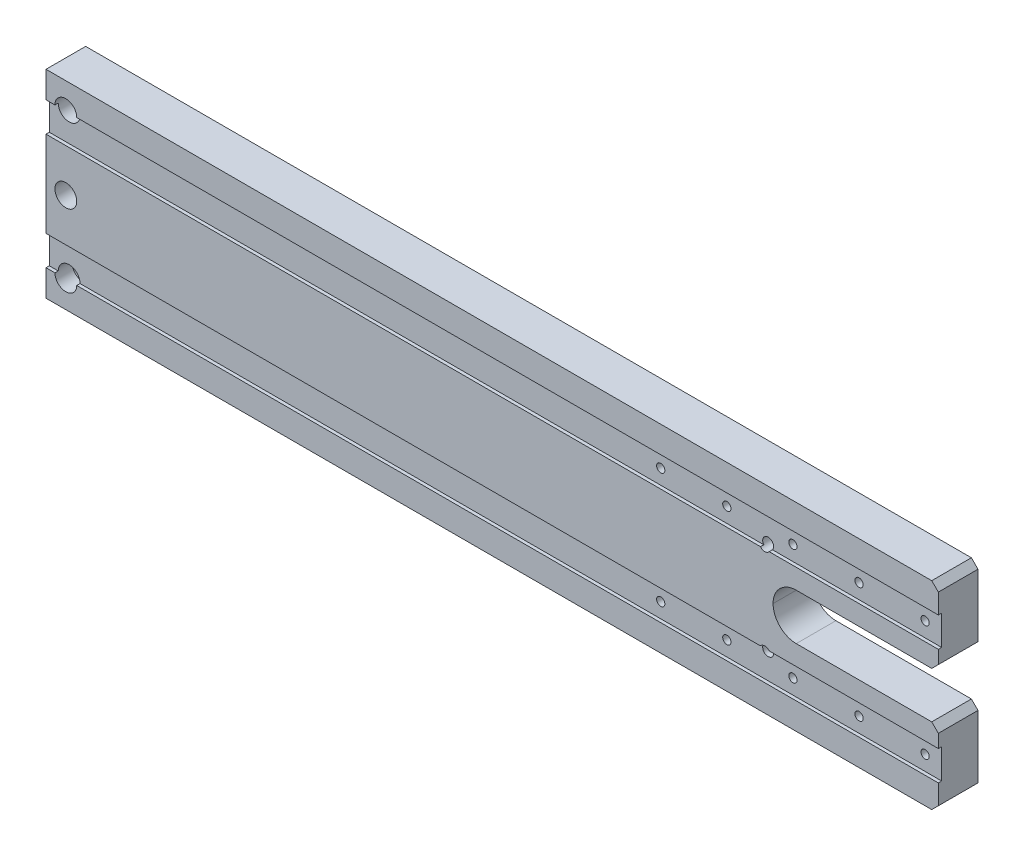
ISO-10303-21;
HEADER;
FILE_DESCRIPTION(('STEP AP214'),'2;1');
FILE_NAME('part.step','',(''),(''),'','','');
FILE_SCHEMA(('AUTOMOTIVE_DESIGN { 1 0 10303 214 1 1 1 1 }'));
ENDSEC;
DATA;
#1=APPLICATION_CONTEXT('core data for automotive mechanical design processes');
#2=APPLICATION_PROTOCOL_DEFINITION('international standard','automotive_design',2000,#1);
#3=PRODUCT_CONTEXT('',#1,'mechanical');
#4=PRODUCT('Part','Part','',(#3));
#5=PRODUCT_RELATED_PRODUCT_CATEGORY('part','',(#4));
#6=PRODUCT_DEFINITION_FORMATION('','',#4);
#7=PRODUCT_DEFINITION_CONTEXT('part definition',#1,'design');
#8=PRODUCT_DEFINITION('design','',#6,#7);
#9=PRODUCT_DEFINITION_SHAPE('','',#8);
#10=(LENGTH_UNIT() NAMED_UNIT(*) SI_UNIT(.MILLI.,.METRE.));
#11=(NAMED_UNIT(*) PLANE_ANGLE_UNIT() SI_UNIT($,.RADIAN.));
#12=(NAMED_UNIT(*) SI_UNIT($,.STERADIAN.) SOLID_ANGLE_UNIT());
#13=UNCERTAINTY_MEASURE_WITH_UNIT(LENGTH_MEASURE(1.E-05),#10,'distance_accuracy_value','');
#14=(GEOMETRIC_REPRESENTATION_CONTEXT(3) GLOBAL_UNCERTAINTY_ASSIGNED_CONTEXT((#13)) GLOBAL_UNIT_ASSIGNED_CONTEXT((#10,
#11,#12)) REPRESENTATION_CONTEXT('',''));
#15=CARTESIAN_POINT('',(0.,0.,0.));
#16=DIRECTION('',(0.,0.,1.));
#17=DIRECTION('',(1.,0.,0.));
#18=AXIS2_PLACEMENT_3D('',#15,#16,#17);
#19=CARTESIAN_POINT('',(-20.,51.7070749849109,12.));
#20=DIRECTION('',(0.,-1.,0.));
#21=DIRECTION('',(0.,0.,-1.));
#22=AXIS2_PLACEMENT_3D('',#19,#20,#21);
#23=PLANE('',#22);
#24=DIRECTION('',(1.,0.,0.));
#25=VECTOR('',#24,1.);
#26=CARTESIAN_POINT('',(-20.,51.7070749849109,12.));
#27=LINE('',#26,#25);
#28=CARTESIAN_POINT('',(-20.,51.7070749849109,12.));
#29=VERTEX_POINT('',#28);
#30=CARTESIAN_POINT('',(196.187559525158,51.7070749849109,12.));
#31=VERTEX_POINT('',#30);
#32=EDGE_CURVE('E226',#29,#31,#27,.T.);
#33=ORIENTED_EDGE('',*,*,#32,.T.);
#34=DIRECTION('',(0.,0.,-1.));
#35=VECTOR('',#34,1.);
#36=CARTESIAN_POINT('',(196.187559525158,51.7070749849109,0.));
#37=LINE('',#36,#35);
#38=CARTESIAN_POINT('',(196.187559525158,51.7070749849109,11.));
#39=VERTEX_POINT('',#38);
#40=EDGE_CURVE('E206',#31,#39,#37,.T.);
#41=ORIENTED_EDGE('',*,*,#40,.T.);
#42=DIRECTION('',(1.,0.,0.));
#43=VECTOR('',#42,1.);
#44=CARTESIAN_POINT('',(-20.,51.7070749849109,11.));
#45=LINE('',#44,#43);
#46=CARTESIAN_POINT('',(-20.,51.7070749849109,11.));
#47=VERTEX_POINT('',#46);
#48=EDGE_CURVE('E236',#47,#39,#45,.T.);
#49=ORIENTED_EDGE('',*,*,#48,.F.);
#50=DIRECTION('',(0.,0.,-1.));
#51=VECTOR('',#50,1.);
#52=CARTESIAN_POINT('',(-20.,51.7070749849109,12.));
#53=LINE('',#52,#51);
#54=EDGE_CURVE('E233',#29,#47,#53,.T.);
#55=ORIENTED_EDGE('',*,*,#54,.F.);
#56=EDGE_LOOP('',(#33,#41,#49,#55));
#57=FACE_BOUND('',#56,.T.);
#58=ADVANCED_FACE('F16',(#57),#23,.F.);
#59=CARTESIAN_POINT('',(-20.,25.7070749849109,12.));
#60=DIRECTION('',(0.,1.,0.));
#61=DIRECTION('',(0.,0.,1.));
#62=AXIS2_PLACEMENT_3D('',#59,#60,#61);
#63=PLANE('',#62);
#64=DIRECTION('',(1.,0.,0.));
#65=VECTOR('',#64,1.);
#66=CARTESIAN_POINT('',(-20.,25.7070749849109,12.));
#67=LINE('',#66,#65);
#68=CARTESIAN_POINT('',(198.81244047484,25.7070749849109,12.));
#69=VERTEX_POINT('',#68);
#70=CARTESIAN_POINT('',(250.,25.7070749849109,12.));
#71=VERTEX_POINT('',#70);
#72=EDGE_CURVE('E579',#69,#71,#67,.T.);
#73=ORIENTED_EDGE('',*,*,#72,.F.);
#74=DIRECTION('',(0.,0.,-1.));
#75=VECTOR('',#74,1.);
#76=CARTESIAN_POINT('',(198.81244047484,25.7070749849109,0.));
#77=LINE('',#76,#75);
#78=CARTESIAN_POINT('',(198.81244047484,25.7070749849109,11.));
#79=VERTEX_POINT('',#78);
#80=EDGE_CURVE('E298',#69,#79,#77,.T.);
#81=ORIENTED_EDGE('',*,*,#80,.T.);
#82=DIRECTION('',(1.,0.,0.));
#83=VECTOR('',#82,1.);
#84=CARTESIAN_POINT('',(-20.,25.7070749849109,11.));
#85=LINE('',#84,#83);
#86=CARTESIAN_POINT('',(250.,25.7070749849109,11.));
#87=VERTEX_POINT('',#86);
#88=EDGE_CURVE('E582',#79,#87,#85,.T.);
#89=ORIENTED_EDGE('',*,*,#88,.T.);
#90=DIRECTION('',(0.,0.,1.));
#91=VECTOR('',#90,1.);
#92=CARTESIAN_POINT('',(250.,25.7070749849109,12.));
#93=LINE('',#92,#91);
#94=EDGE_CURVE('E561',#87,#71,#93,.T.);
#95=ORIENTED_EDGE('',*,*,#94,.T.);
#96=EDGE_LOOP('',(#73,#81,#89,#95));
#97=FACE_BOUND('',#96,.T.);
#98=ADVANCED_FACE('F406',(#97),#63,.F.);
#99=CARTESIAN_POINT('',(250.,68.7070749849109,12.));
#100=DIRECTION('',(-1.,0.,0.));
#101=DIRECTION('',(0.,0.,1.));
#102=AXIS2_PLACEMENT_3D('',#99,#100,#101);
#103=PLANE('',#102);
#104=DIRECTION('',(0.,1.,0.));
#105=VECTOR('',#104,1.);
#106=CARTESIAN_POINT('',(250.,68.7070749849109,12.));
#107=LINE('',#106,#105);
#108=CARTESIAN_POINT('',(250.,47.7070749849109,12.));
#109=VERTEX_POINT('',#108);
#110=CARTESIAN_POINT('',(250.,51.7070749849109,12.));
#111=VERTEX_POINT('',#110);
#112=EDGE_CURVE('E250',#109,#111,#107,.T.);
#113=ORIENTED_EDGE('',*,*,#112,.F.);
#114=DIRECTION('',(0.,0.,-1.));
#115=VECTOR('',#114,1.);
#116=CARTESIAN_POINT('',(250.,47.7070749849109,12.));
#117=LINE('',#116,#115);
#118=CARTESIAN_POINT('',(250.,47.7070749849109,0.));
#119=VERTEX_POINT('',#118);
#120=EDGE_CURVE('E326',#109,#119,#117,.T.);
#121=ORIENTED_EDGE('',*,*,#120,.T.);
#122=DIRECTION('',(0.,1.,0.));
#123=VECTOR('',#122,1.);
#124=CARTESIAN_POINT('',(250.,68.7070749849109,0.));
#125=LINE('',#124,#123);
#126=CARTESIAN_POINT('',(250.,66.7070749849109,0.));
#127=VERTEX_POINT('',#126);
#128=EDGE_CURVE('E264',#119,#127,#125,.T.);
#129=ORIENTED_EDGE('',*,*,#128,.T.);
#130=DIRECTION('',(0.,0.,1.));
#131=VECTOR('',#130,1.);
#132=CARTESIAN_POINT('',(250.,66.7070749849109,12.));
#133=LINE('',#132,#131);
#134=CARTESIAN_POINT('',(250.,66.7070749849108,12.));
#135=VERTEX_POINT('',#134);
#136=EDGE_CURVE('E37',#127,#135,#133,.T.);
#137=ORIENTED_EDGE('',*,*,#136,.T.);
#138=CARTESIAN_POINT('',(250.,60.7070749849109,12.));
#139=VERTEX_POINT('',#138);
#140=EDGE_CURVE('E249',#139,#135,#107,.T.);
#141=ORIENTED_EDGE('',*,*,#140,.F.);
#142=DIRECTION('',(0.,0.,1.));
#143=VECTOR('',#142,1.);
#144=CARTESIAN_POINT('',(250.,60.7070749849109,12.));
#145=LINE('',#144,#143);
#146=CARTESIAN_POINT('',(250.,60.7070749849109,11.));
#147=VERTEX_POINT('',#146);
#148=EDGE_CURVE('E362',#147,#139,#145,.T.);
#149=ORIENTED_EDGE('',*,*,#148,.F.);
#150=DIRECTION('',(0.,1.,0.));
#151=VECTOR('',#150,1.);
#152=CARTESIAN_POINT('',(250.,60.7070749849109,11.));
#153=LINE('',#152,#151);
#154=CARTESIAN_POINT('',(250.,51.7070749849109,11.));
#155=VERTEX_POINT('',#154);
#156=EDGE_CURVE('E380',#155,#147,#153,.T.);
#157=ORIENTED_EDGE('',*,*,#156,.F.);
#158=DIRECTION('',(0.,0.,-1.));
#159=VECTOR('',#158,1.);
#160=CARTESIAN_POINT('',(250.,51.7070749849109,12.));
#161=LINE('',#160,#159);
#162=EDGE_CURVE('E386',#111,#155,#161,.T.);
#163=ORIENTED_EDGE('',*,*,#162,.F.);
#164=EDGE_LOOP('',(#113,#121,#129,#137,#141,#149,#157,#163));
#165=FACE_BOUND('',#164,.T.);
#166=ADVANCED_FACE('F393',(#165),#103,.F.);
#167=CARTESIAN_POINT('',(-20.,60.7070749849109,11.));
#168=DIRECTION('',(0.,0.,-1.));
#169=DIRECTION('',(0.,1.,0.));
#170=AXIS2_PLACEMENT_3D('',#167,#168,#169);
#171=PLANE('',#170);
#172=CARTESIAN_POINT('',(165.,56.2070749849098,11.));
#173=DIRECTION('',(0.,0.,1.));
#174=DIRECTION('',(1.,0.,0.));
#175=AXIS2_PLACEMENT_3D('',#172,#173,#174);
#176=CIRCLE('',#175,1.24999999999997);
#177=CARTESIAN_POINT('',(166.25,56.2070749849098,11.));
#178=VERTEX_POINT('',#177);
#179=EDGE_CURVE('E459',#178,#178,#176,.T.);
#180=ORIENTED_EDGE('',*,*,#179,.F.);
#181=EDGE_LOOP('',(#180));
#182=FACE_BOUND('',#181,.T.);
#183=CARTESIAN_POINT('',(205.,56.2070749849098,11.));
#184=DIRECTION('',(0.,0.,1.));
#185=DIRECTION('',(1.,0.,0.));
#186=AXIS2_PLACEMENT_3D('',#183,#184,#185);
#187=CIRCLE('',#186,1.24999999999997);
#188=CARTESIAN_POINT('',(206.25,56.2070749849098,11.));
#189=VERTEX_POINT('',#188);
#190=EDGE_CURVE('E465',#189,#189,#187,.T.);
#191=ORIENTED_EDGE('',*,*,#190,.F.);
#192=EDGE_LOOP('',(#191));
#193=FACE_BOUND('',#192,.T.);
#194=CARTESIAN_POINT('',(225.,56.2070749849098,11.));
#195=DIRECTION('',(0.,0.,1.));
#196=DIRECTION('',(1.,0.,0.));
#197=AXIS2_PLACEMENT_3D('',#194,#195,#196);
#198=CIRCLE('',#197,1.25);
#199=CARTESIAN_POINT('',(226.25,56.2070749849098,11.));
#200=VERTEX_POINT('',#199);
#201=EDGE_CURVE('E471',#200,#200,#198,.T.);
#202=ORIENTED_EDGE('',*,*,#201,.F.);
#203=EDGE_LOOP('',(#202));
#204=FACE_BOUND('',#203,.T.);
#205=CARTESIAN_POINT('',(245.,56.2070749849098,11.));
#206=DIRECTION('',(0.,0.,1.));
#207=DIRECTION('',(1.,0.,0.));
#208=AXIS2_PLACEMENT_3D('',#205,#206,#207);
#209=CIRCLE('',#208,1.24999999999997);
#210=CARTESIAN_POINT('',(246.25,56.2070749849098,11.));
#211=VERTEX_POINT('',#210);
#212=EDGE_CURVE('E477',#211,#211,#209,.T.);
#213=ORIENTED_EDGE('',*,*,#212,.F.);
#214=EDGE_LOOP('',(#213));
#215=FACE_BOUND('',#214,.T.);
#216=ORIENTED_EDGE('',*,*,#48,.T.);
#217=CARTESIAN_POINT('',(197.5,52.7070749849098,11.));
#218=DIRECTION('',(0.,0.,-1.));
#219=DIRECTION('',(0.,1.,0.));
#220=AXIS2_PLACEMENT_3D('',#217,#218,#219);
#221=CIRCLE('',#220,1.65);
#222=CARTESIAN_POINT('',(198.812440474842,51.7070749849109,11.));
#223=VERTEX_POINT('',#222);
#224=EDGE_CURVE('E212',#39,#223,#221,.T.);
#225=ORIENTED_EDGE('',*,*,#224,.T.);
#226=EDGE_CURVE('E234',#223,#155,#45,.T.);
#227=ORIENTED_EDGE('',*,*,#226,.T.);
#228=ORIENTED_EDGE('',*,*,#156,.T.);
#229=DIRECTION('',(1.,0.,0.));
#230=VECTOR('',#229,1.);
#231=CARTESIAN_POINT('',(-20.,60.7070749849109,11.));
#232=LINE('',#231,#230);
#233=CARTESIAN_POINT('',(-10.7,60.7070749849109,11.));
#234=VERTEX_POINT('',#233);
#235=EDGE_CURVE('E365',#234,#147,#232,.T.);
#236=ORIENTED_EDGE('',*,*,#235,.F.);
#237=CARTESIAN_POINT('',(-14.,60.7070749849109,11.));
#238=DIRECTION('',(0.,0.,-1.));
#239=DIRECTION('',(0.,1.,0.));
#240=AXIS2_PLACEMENT_3D('',#237,#238,#239);
#241=CIRCLE('',#240,3.3);
#242=CARTESIAN_POINT('',(-17.3,60.7070749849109,11.));
#243=VERTEX_POINT('',#242);
#244=EDGE_CURVE('E277',#234,#243,#241,.T.);
#245=ORIENTED_EDGE('',*,*,#244,.T.);
#246=CARTESIAN_POINT('',(-20.,60.7070749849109,11.));
#247=VERTEX_POINT('',#246);
#248=EDGE_CURVE('E360',#247,#243,#232,.T.);
#249=ORIENTED_EDGE('',*,*,#248,.F.);
#250=DIRECTION('',(0.,1.,0.));
#251=VECTOR('',#250,1.);
#252=CARTESIAN_POINT('',(-20.,60.7070749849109,11.));
#253=LINE('',#252,#251);
#254=EDGE_CURVE('E376',#47,#247,#253,.T.);
#255=ORIENTED_EDGE('',*,*,#254,.F.);
#256=EDGE_LOOP('',(#216,#225,#227,#228,#236,#245,#249,#255));
#257=FACE_BOUND('',#256,.T.);
#258=CARTESIAN_POINT('',(185.,56.2070749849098,11.));
#259=DIRECTION('',(0.,0.,1.));
#260=DIRECTION('',(1.,0.,0.));
#261=AXIS2_PLACEMENT_3D('',#258,#259,#260);
#262=CIRCLE('',#261,1.24999999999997);
#263=CARTESIAN_POINT('',(186.25,56.2070749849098,11.));
#264=VERTEX_POINT('',#263);
#265=EDGE_CURVE('E446',#264,#264,#262,.T.);
#266=ORIENTED_EDGE('',*,*,#265,.F.);
#267=EDGE_LOOP('',(#266));
#268=FACE_BOUND('',#267,.T.);
#269=ADVANCED_FACE('F373',(#182,#193,#204,#215,#257,#268),#171,.F.);
#270=CARTESIAN_POINT('',(-20.,60.7070749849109,12.));
#271=DIRECTION('',(0.,1.,0.));
#272=DIRECTION('',(0.,0.,1.));
#273=AXIS2_PLACEMENT_3D('',#270,#271,#272);
#274=PLANE('',#273);
#275=DIRECTION('',(1.,0.,0.));
#276=VECTOR('',#275,1.);
#277=CARTESIAN_POINT('',(-20.,60.7070749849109,12.));
#278=LINE('',#277,#276);
#279=CARTESIAN_POINT('',(-10.7,60.7070749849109,12.));
#280=VERTEX_POINT('',#279);
#281=EDGE_CURVE('E358',#280,#139,#278,.T.);
#282=ORIENTED_EDGE('',*,*,#281,.F.);
#283=DIRECTION('',(0.,0.,-1.));
#284=VECTOR('',#283,1.);
#285=CARTESIAN_POINT('',(-10.7,60.7070749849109,0.));
#286=LINE('',#285,#284);
#287=EDGE_CURVE('E395',#280,#234,#286,.T.);
#288=ORIENTED_EDGE('',*,*,#287,.T.);
#289=ORIENTED_EDGE('',*,*,#235,.T.);
#290=ORIENTED_EDGE('',*,*,#148,.T.);
#291=EDGE_LOOP('',(#282,#288,#289,#290));
#292=FACE_BOUND('',#291,.T.);
#293=ADVANCED_FACE('F394',(#292),#274,.F.);
#294=CARTESIAN_POINT('',(-20.,16.7070749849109,12.));
#295=DIRECTION('',(0.,-1.,0.));
#296=DIRECTION('',(0.,0.,-1.));
#297=AXIS2_PLACEMENT_3D('',#294,#295,#296);
#298=PLANE('',#297);
#299=DIRECTION('',(1.,0.,0.));
#300=VECTOR('',#299,1.);
#301=CARTESIAN_POINT('',(-20.,16.7070749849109,12.));
#302=LINE('',#301,#300);
#303=CARTESIAN_POINT('',(-20.,16.7070749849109,12.));
#304=VERTEX_POINT('',#303);
#305=CARTESIAN_POINT('',(-17.3,16.7070749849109,12.));
#306=VERTEX_POINT('',#305);
#307=EDGE_CURVE('E388',#304,#306,#302,.T.);
#308=ORIENTED_EDGE('',*,*,#307,.T.);
#309=DIRECTION('',(0.,0.,-1.));
#310=VECTOR('',#309,1.);
#311=CARTESIAN_POINT('',(-17.3,16.7070749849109,0.));
#312=LINE('',#311,#310);
#313=CARTESIAN_POINT('',(-17.3,16.7070749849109,11.));
#314=VERTEX_POINT('',#313);
#315=EDGE_CURVE('E553',#306,#314,#312,.T.);
#316=ORIENTED_EDGE('',*,*,#315,.T.);
#317=DIRECTION('',(1.,0.,0.));
#318=VECTOR('',#317,1.);
#319=CARTESIAN_POINT('',(-20.,16.7070749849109,11.));
#320=LINE('',#319,#318);
#321=CARTESIAN_POINT('',(-20.,16.7070749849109,11.));
#322=VERTEX_POINT('',#321);
#323=EDGE_CURVE('E382',#322,#314,#320,.T.);
#324=ORIENTED_EDGE('',*,*,#323,.F.);
#325=DIRECTION('',(0.,0.,-1.));
#326=VECTOR('',#325,1.);
#327=CARTESIAN_POINT('',(-20.,16.7070749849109,12.));
#328=LINE('',#327,#326);
#329=EDGE_CURVE('E557',#304,#322,#328,.T.);
#330=ORIENTED_EDGE('',*,*,#329,.F.);
#331=EDGE_LOOP('',(#308,#316,#324,#330));
#332=FACE_BOUND('',#331,.T.);
#333=ADVANCED_FACE('F429',(#332),#298,.F.);
#334=CARTESIAN_POINT('',(0.,0.,12.));
#335=DIRECTION('',(0.,0.,1.));
#336=DIRECTION('',(1.,0.,0.));
#337=AXIS2_PLACEMENT_3D('',#334,#335,#336);
#338=PLANE('',#337);
#339=DIRECTION('',(1.,0.,0.));
#340=VECTOR('',#339,1.);
#341=CARTESIAN_POINT('',(-20.,8.70707498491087,12.));
#342=LINE('',#341,#340);
#343=CARTESIAN_POINT('',(-20.,8.70707498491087,12.));
#344=VERTEX_POINT('',#343);
#345=CARTESIAN_POINT('',(248.,8.70707498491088,12.));
#346=VERTEX_POINT('',#345);
#347=EDGE_CURVE('E244',#344,#346,#342,.T.);
#348=ORIENTED_EDGE('',*,*,#347,.T.);
#349=DIRECTION('',(-0.707106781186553,-0.707106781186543,0.));
#350=VECTOR('',#349,1.);
#351=CARTESIAN_POINT('',(119.646462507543,-119.646462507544,12.));
#352=LINE('',#351,#350);
#353=CARTESIAN_POINT('',(250.,10.7070749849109,12.));
#354=VERTEX_POINT('',#353);
#355=EDGE_CURVE('E316',#346,#354,#352,.F.);
#356=ORIENTED_EDGE('',*,*,#355,.T.);
#357=CARTESIAN_POINT('',(250.,16.7070749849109,12.));
#358=VERTEX_POINT('',#357);
#359=EDGE_CURVE('E253',#354,#358,#107,.T.);
#360=ORIENTED_EDGE('',*,*,#359,.T.);
#361=CARTESIAN_POINT('',(-10.7,16.7070749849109,12.));
#362=VERTEX_POINT('',#361);
#363=EDGE_CURVE('E576',#362,#358,#302,.T.);
#364=ORIENTED_EDGE('',*,*,#363,.F.);
#365=CARTESIAN_POINT('',(-14.,16.7070749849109,12.));
#366=DIRECTION('',(0.,0.,-1.));
#367=DIRECTION('',(-1.,0.,0.));
#368=AXIS2_PLACEMENT_3D('',#365,#366,#367);
#369=CIRCLE('',#368,3.3);
#370=EDGE_CURVE('E547',#362,#306,#369,.T.);
#371=ORIENTED_EDGE('',*,*,#370,.T.);
#372=ORIENTED_EDGE('',*,*,#307,.F.);
#373=DIRECTION('',(0.,-1.,0.));
#374=VECTOR('',#373,1.);
#375=CARTESIAN_POINT('',(-20.,68.7070749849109,12.));
#376=LINE('',#375,#374);
#377=EDGE_CURVE('E246',#304,#344,#376,.T.);
#378=ORIENTED_EDGE('',*,*,#377,.T.);
#379=EDGE_LOOP('',(#348,#356,#360,#364,#371,#372,#378));
#380=FACE_BOUND('',#379,.T.);
#381=ADVANCED_FACE('F958',(#380),#338,.T.);
#382=ORIENTED_EDGE('',*,*,#140,.T.);
#383=DIRECTION('',(0.707106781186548,-0.707106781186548,0.));
#384=VECTOR('',#383,1.);
#385=CARTESIAN_POINT('',(158.353537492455,158.353537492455,12.));
#386=LINE('',#385,#384);
#387=CARTESIAN_POINT('',(248.,68.7070749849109,12.));
#388=VERTEX_POINT('',#387);
#389=EDGE_CURVE('E11',#135,#388,#386,.F.);
#390=ORIENTED_EDGE('',*,*,#389,.T.);
#391=DIRECTION('',(-1.,0.,0.));
#392=VECTOR('',#391,1.);
#393=CARTESIAN_POINT('',(-20.,68.7070749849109,12.));
#394=LINE('',#393,#392);
#395=CARTESIAN_POINT('',(-20.,68.7070749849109,12.));
#396=VERTEX_POINT('',#395);
#397=EDGE_CURVE('E254',#388,#396,#394,.T.);
#398=ORIENTED_EDGE('',*,*,#397,.T.);
#399=CARTESIAN_POINT('',(-20.,60.7070749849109,12.));
#400=VERTEX_POINT('',#399);
#401=EDGE_CURVE('E241',#396,#400,#376,.T.);
#402=ORIENTED_EDGE('',*,*,#401,.T.);
#403=CARTESIAN_POINT('',(-17.3,60.7070749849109,12.));
#404=VERTEX_POINT('',#403);
#405=EDGE_CURVE('E261',#400,#404,#278,.T.);
#406=ORIENTED_EDGE('',*,*,#405,.T.);
#407=CARTESIAN_POINT('',(-14.,60.7070749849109,12.));
#408=DIRECTION('',(0.,0.,-1.));
#409=DIRECTION('',(-1.,0.,0.));
#410=AXIS2_PLACEMENT_3D('',#407,#408,#409);
#411=CIRCLE('',#410,3.3);
#412=EDGE_CURVE('E354',#404,#280,#411,.T.);
#413=ORIENTED_EDGE('',*,*,#412,.T.);
#414=ORIENTED_EDGE('',*,*,#281,.T.);
#415=EDGE_LOOP('',(#382,#390,#398,#402,#406,#413,#414));
#416=FACE_BOUND('',#415,.T.);
#417=ADVANCED_FACE('F352',(#416),#338,.T.);
#418=CARTESIAN_POINT('',(-20.,68.7070749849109,12.));
#419=DIRECTION('',(1.,0.,0.));
#420=DIRECTION('',(0.,1.,0.));
#421=AXIS2_PLACEMENT_3D('',#418,#419,#420);
#422=PLANE('',#421);
#423=ORIENTED_EDGE('',*,*,#377,.F.);
#424=ORIENTED_EDGE('',*,*,#329,.T.);
#425=DIRECTION('',(0.,1.,0.));
#426=VECTOR('',#425,1.);
#427=CARTESIAN_POINT('',(-20.,16.7070749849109,11.));
#428=LINE('',#427,#426);
#429=CARTESIAN_POINT('',(-20.,25.7070749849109,11.));
#430=VERTEX_POINT('',#429);
#431=EDGE_CURVE('E560',#322,#430,#428,.T.);
#432=ORIENTED_EDGE('',*,*,#431,.T.);
#433=DIRECTION('',(0.,0.,1.));
#434=VECTOR('',#433,1.);
#435=CARTESIAN_POINT('',(-20.,25.7070749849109,12.));
#436=LINE('',#435,#434);
#437=CARTESIAN_POINT('',(-20.,25.7070749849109,12.));
#438=VERTEX_POINT('',#437);
#439=EDGE_CURVE('E564',#430,#438,#436,.T.);
#440=ORIENTED_EDGE('',*,*,#439,.T.);
#441=EDGE_CURVE('E245',#29,#438,#376,.T.);
#442=ORIENTED_EDGE('',*,*,#441,.F.);
#443=ORIENTED_EDGE('',*,*,#54,.T.);
#444=ORIENTED_EDGE('',*,*,#254,.T.);
#445=DIRECTION('',(0.,0.,1.));
#446=VECTOR('',#445,1.);
#447=CARTESIAN_POINT('',(-20.,60.7070749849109,12.));
#448=LINE('',#447,#446);
#449=EDGE_CURVE('E238',#247,#400,#448,.T.);
#450=ORIENTED_EDGE('',*,*,#449,.T.);
#451=ORIENTED_EDGE('',*,*,#401,.F.);
#452=DIRECTION('',(0.,0.,-1.));
#453=VECTOR('',#452,1.);
#454=CARTESIAN_POINT('',(-20.,68.7070749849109,12.));
#455=LINE('',#454,#453);
#456=CARTESIAN_POINT('',(-20.,68.7070749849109,0.));
#457=VERTEX_POINT('',#456);
#458=EDGE_CURVE('E256',#396,#457,#455,.T.);
#459=ORIENTED_EDGE('',*,*,#458,.T.);
#460=DIRECTION('',(0.,-1.,0.));
#461=VECTOR('',#460,1.);
#462=CARTESIAN_POINT('',(-20.,68.7070749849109,0.));
#463=LINE('',#462,#461);
#464=CARTESIAN_POINT('',(-20.,8.70707498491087,0.));
#465=VERTEX_POINT('',#464);
#466=EDGE_CURVE('E257',#457,#465,#463,.T.);
#467=ORIENTED_EDGE('',*,*,#466,.T.);
#468=DIRECTION('',(0.,0.,-1.));
#469=VECTOR('',#468,1.);
#470=CARTESIAN_POINT('',(-20.,8.70707498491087,12.));
#471=LINE('',#470,#469);
#472=EDGE_CURVE('E271',#344,#465,#471,.T.);
#473=ORIENTED_EDGE('',*,*,#472,.F.);
#474=EDGE_LOOP('',(#423,#424,#432,#440,#442,#443,#444,#450,#451,#459,#467,#473));
#475=FACE_BOUND('',#474,.T.);
#476=ADVANCED_FACE('F346',(#475),#422,.F.);
#477=CARTESIAN_POINT('',(-20.,8.70707498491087,12.));
#478=DIRECTION('',(0.,1.,0.));
#479=DIRECTION('',(0.,0.,1.));
#480=AXIS2_PLACEMENT_3D('',#477,#478,#479);
#481=PLANE('',#480);
#482=DIRECTION('',(1.,0.,0.));
#483=VECTOR('',#482,1.);
#484=CARTESIAN_POINT('',(-20.,8.70707498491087,0.));
#485=LINE('',#484,#483);
#486=CARTESIAN_POINT('',(248.,8.70707498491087,0.));
#487=VERTEX_POINT('',#486);
#488=EDGE_CURVE('E260',#465,#487,#485,.T.);
#489=ORIENTED_EDGE('',*,*,#488,.T.);
#490=DIRECTION('',(0.,0.,1.));
#491=VECTOR('',#490,1.);
#492=CARTESIAN_POINT('',(248.,8.70707498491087,12.));
#493=LINE('',#492,#491);
#494=EDGE_CURVE('E314',#487,#346,#493,.T.);
#495=ORIENTED_EDGE('',*,*,#494,.T.);
#496=ORIENTED_EDGE('',*,*,#347,.F.);
#497=ORIENTED_EDGE('',*,*,#472,.T.);
#498=EDGE_LOOP('',(#489,#495,#496,#497));
#499=FACE_BOUND('',#498,.T.);
#500=ADVANCED_FACE('F750',(#499),#481,.F.);
#501=ORIENTED_EDGE('',*,*,#359,.F.);
#502=DIRECTION('',(0.,0.,-1.));
#503=VECTOR('',#502,1.);
#504=CARTESIAN_POINT('',(250.,10.7070749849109,12.));
#505=LINE('',#504,#503);
#506=CARTESIAN_POINT('',(250.,10.7070749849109,0.));
#507=VERTEX_POINT('',#506);
#508=EDGE_CURVE('E303',#354,#507,#505,.T.);
#509=ORIENTED_EDGE('',*,*,#508,.T.);
#510=CARTESIAN_POINT('',(250.,29.7070749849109,0.));
#511=VERTEX_POINT('',#510);
#512=EDGE_CURVE('E266',#507,#511,#125,.T.);
#513=ORIENTED_EDGE('',*,*,#512,.T.);
#514=DIRECTION('',(0.,0.,1.));
#515=VECTOR('',#514,1.);
#516=CARTESIAN_POINT('',(250.,29.7070749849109,12.));
#517=LINE('',#516,#515);
#518=CARTESIAN_POINT('',(250.,29.7070749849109,12.));
#519=VERTEX_POINT('',#518);
#520=EDGE_CURVE('E216',#511,#519,#517,.T.);
#521=ORIENTED_EDGE('',*,*,#520,.T.);
#522=EDGE_CURVE('E252',#71,#519,#107,.T.);
#523=ORIENTED_EDGE('',*,*,#522,.F.);
#524=ORIENTED_EDGE('',*,*,#94,.F.);
#525=DIRECTION('',(0.,1.,0.));
#526=VECTOR('',#525,1.);
#527=CARTESIAN_POINT('',(250.,16.7070749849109,11.));
#528=LINE('',#527,#526);
#529=CARTESIAN_POINT('',(250.,16.7070749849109,11.));
#530=VERTEX_POINT('',#529);
#531=EDGE_CURVE('E569',#530,#87,#528,.T.);
#532=ORIENTED_EDGE('',*,*,#531,.F.);
#533=DIRECTION('',(0.,0.,-1.));
#534=VECTOR('',#533,1.);
#535=CARTESIAN_POINT('',(250.,16.7070749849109,12.));
#536=LINE('',#535,#534);
#537=EDGE_CURVE('E556',#358,#530,#536,.T.);
#538=ORIENTED_EDGE('',*,*,#537,.F.);
#539=EDGE_LOOP('',(#501,#509,#513,#521,#523,#524,#532,#538));
#540=FACE_BOUND('',#539,.T.);
#541=ADVANCED_FACE('F600',(#540),#103,.F.);
#542=CARTESIAN_POINT('',(-20.,68.7070749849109,12.));
#543=DIRECTION('',(0.,-1.,0.));
#544=DIRECTION('',(0.,0.,-1.));
#545=AXIS2_PLACEMENT_3D('',#542,#543,#544);
#546=PLANE('',#545);
#547=ORIENTED_EDGE('',*,*,#397,.F.);
#548=DIRECTION('',(0.,0.,-1.));
#549=VECTOR('',#548,1.);
#550=CARTESIAN_POINT('',(248.,68.7070749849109,12.));
#551=LINE('',#550,#549);
#552=CARTESIAN_POINT('',(248.,68.7070749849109,0.));
#553=VERTEX_POINT('',#552);
#554=EDGE_CURVE('E24',#388,#553,#551,.T.);
#555=ORIENTED_EDGE('',*,*,#554,.T.);
#556=DIRECTION('',(-1.,0.,0.));
#557=VECTOR('',#556,1.);
#558=CARTESIAN_POINT('',(-20.,68.7070749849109,0.));
#559=LINE('',#558,#557);
#560=EDGE_CURVE('E267',#553,#457,#559,.T.);
#561=ORIENTED_EDGE('',*,*,#560,.T.);
#562=ORIENTED_EDGE('',*,*,#458,.F.);
#563=EDGE_LOOP('',(#547,#555,#561,#562));
#564=FACE_BOUND('',#563,.T.);
#565=ADVANCED_FACE('F334',(#564),#546,.F.);
#566=DIRECTION('',(1.,0.,0.));
#567=VECTOR('',#566,1.);
#568=CARTESIAN_POINT('',(200.,45.7070749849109,12.));
#569=LINE('',#568,#567);
#570=CARTESIAN_POINT('',(207.,45.7070749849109,12.));
#571=VERTEX_POINT('',#570);
#572=CARTESIAN_POINT('',(248.,45.7070749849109,12.));
#573=VERTEX_POINT('',#572);
#574=EDGE_CURVE('E443',#571,#573,#569,.T.);
#575=ORIENTED_EDGE('',*,*,#574,.T.);
#576=DIRECTION('',(-0.707106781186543,-0.707106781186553,0.));
#577=VECTOR('',#576,1.);
#578=CARTESIAN_POINT('',(101.146462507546,-101.146462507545,12.));
#579=LINE('',#578,#577);
#580=EDGE_CURVE('E323',#573,#109,#579,.F.);
#581=ORIENTED_EDGE('',*,*,#580,.T.);
#582=ORIENTED_EDGE('',*,*,#112,.T.);
#583=CARTESIAN_POINT('',(198.812440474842,51.7070749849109,12.));
#584=VERTEX_POINT('',#583);
#585=EDGE_CURVE('E229',#584,#111,#27,.T.);
#586=ORIENTED_EDGE('',*,*,#585,.F.);
#587=CARTESIAN_POINT('',(197.5,52.7070749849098,12.));
#588=DIRECTION('',(0.,0.,-1.));
#589=DIRECTION('',(-1.,0.,0.));
#590=AXIS2_PLACEMENT_3D('',#587,#588,#589);
#591=CIRCLE('',#590,1.65);
#592=EDGE_CURVE('E209',#584,#31,#591,.T.);
#593=ORIENTED_EDGE('',*,*,#592,.T.);
#594=ORIENTED_EDGE('',*,*,#32,.F.);
#595=ORIENTED_EDGE('',*,*,#441,.T.);
#596=CARTESIAN_POINT('',(196.18755952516,25.7070749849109,12.));
#597=VERTEX_POINT('',#596);
#598=EDGE_CURVE('E577',#438,#597,#67,.T.);
#599=ORIENTED_EDGE('',*,*,#598,.T.);
#600=CARTESIAN_POINT('',(197.5,24.7070749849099,12.));
#601=DIRECTION('',(0.,0.,-1.));
#602=DIRECTION('',(-1.,0.,0.));
#603=AXIS2_PLACEMENT_3D('',#600,#601,#602);
#604=CIRCLE('',#603,1.65);
#605=EDGE_CURVE('E606',#597,#69,#604,.T.);
#606=ORIENTED_EDGE('',*,*,#605,.T.);
#607=ORIENTED_EDGE('',*,*,#72,.T.);
#608=ORIENTED_EDGE('',*,*,#522,.T.);
#609=DIRECTION('',(0.707106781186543,-0.707106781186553,0.));
#610=VECTOR('',#609,1.);
#611=CARTESIAN_POINT('',(139.853537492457,139.853537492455,12.));
#612=LINE('',#611,#610);
#613=CARTESIAN_POINT('',(248.,31.7070749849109,12.));
#614=VERTEX_POINT('',#613);
#615=EDGE_CURVE('E321',#519,#614,#612,.F.);
#616=ORIENTED_EDGE('',*,*,#615,.T.);
#617=DIRECTION('',(1.,0.,0.));
#618=VECTOR('',#617,1.);
#619=CARTESIAN_POINT('',(200.,31.7070749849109,12.));
#620=LINE('',#619,#618);
#621=CARTESIAN_POINT('',(207.,31.7070749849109,12.));
#622=VERTEX_POINT('',#621);
#623=EDGE_CURVE('E297',#622,#614,#620,.T.);
#624=ORIENTED_EDGE('',*,*,#623,.F.);
#625=CARTESIAN_POINT('',(207.,38.7070749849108,12.));
#626=DIRECTION('',(0.,0.,1.));
#627=DIRECTION('',(1.,0.,0.));
#628=AXIS2_PLACEMENT_3D('',#625,#626,#627);
#629=CIRCLE('',#628,7.);
#630=CARTESIAN_POINT('',(200.,38.7070749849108,12.));
#631=VERTEX_POINT('',#630);
#632=EDGE_CURVE('E287',#622,#631,#629,.F.);
#633=ORIENTED_EDGE('',*,*,#632,.T.);
#634=CARTESIAN_POINT('',(207.,38.7070749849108,12.));
#635=DIRECTION('',(0.,0.,1.));
#636=DIRECTION('',(1.,0.,0.));
#637=AXIS2_PLACEMENT_3D('',#634,#635,#636);
#638=CIRCLE('',#637,7.);
#639=EDGE_CURVE('E289',#631,#571,#638,.F.);
#640=ORIENTED_EDGE('',*,*,#639,.T.);
#641=EDGE_LOOP('',(#575,#581,#582,#586,#593,#594,#595,#599,#606,#607,#608,#616,#624,#633,#640));
#642=FACE_BOUND('',#641,.T.);
#643=CARTESIAN_POINT('',(-14.,38.7070749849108,12.));
#644=DIRECTION('',(0.,0.,-1.));
#645=DIRECTION('',(-1.,0.,0.));
#646=AXIS2_PLACEMENT_3D('',#643,#644,#645);
#647=CIRCLE('',#646,3.3);
#648=CARTESIAN_POINT('',(-17.3,38.7070749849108,12.));
#649=VERTEX_POINT('',#648);
#650=EDGE_CURVE('E535',#649,#649,#647,.T.);
#651=ORIENTED_EDGE('',*,*,#650,.T.);
#652=EDGE_LOOP('',(#651));
#653=FACE_BOUND('',#652,.T.);
#654=ADVANCED_FACE('F223',(#642,#653),#338,.T.);
#655=CARTESIAN_POINT('',(0.,0.,0.));
#656=DIRECTION('',(0.,0.,1.));
#657=DIRECTION('',(1.,0.,0.));
#658=AXIS2_PLACEMENT_3D('',#655,#656,#657);
#659=PLANE('',#658);
#660=CARTESIAN_POINT('',(197.5,52.7070749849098,0.));
#661=DIRECTION('',(0.,0.,-1.));
#662=DIRECTION('',(-1.,0.,0.));
#663=AXIS2_PLACEMENT_3D('',#660,#661,#662);
#664=CIRCLE('',#663,1.65);
#665=CARTESIAN_POINT('',(195.85,52.7070749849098,0.));
#666=VERTEX_POINT('',#665);
#667=EDGE_CURVE('E230',#666,#666,#664,.T.);
#668=ORIENTED_EDGE('',*,*,#667,.F.);
#669=EDGE_LOOP('',(#668));
#670=FACE_BOUND('',#669,.T.);
#671=CARTESIAN_POINT('',(197.5,24.7070749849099,0.));
#672=DIRECTION('',(0.,0.,-1.));
#673=DIRECTION('',(-1.,0.,0.));
#674=AXIS2_PLACEMENT_3D('',#671,#672,#673);
#675=CIRCLE('',#674,1.65);
#676=CARTESIAN_POINT('',(195.85,24.7070749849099,0.));
#677=VERTEX_POINT('',#676);
#678=EDGE_CURVE('E609',#677,#677,#675,.T.);
#679=ORIENTED_EDGE('',*,*,#678,.F.);
#680=EDGE_LOOP('',(#679));
#681=FACE_BOUND('',#680,.T.);
#682=ORIENTED_EDGE('',*,*,#512,.F.);
#683=DIRECTION('',(0.707106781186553,0.707106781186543,0.));
#684=VECTOR('',#683,1.);
#685=CARTESIAN_POINT('',(250.,10.7070749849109,0.));
#686=LINE('',#685,#684);
#687=EDGE_CURVE('E312',#507,#487,#686,.F.);
#688=ORIENTED_EDGE('',*,*,#687,.T.);
#689=ORIENTED_EDGE('',*,*,#488,.F.);
#690=ORIENTED_EDGE('',*,*,#466,.F.);
#691=ORIENTED_EDGE('',*,*,#560,.F.);
#692=DIRECTION('',(-0.707106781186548,0.707106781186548,0.));
#693=VECTOR('',#692,1.);
#694=CARTESIAN_POINT('',(248.,68.7070749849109,0.));
#695=LINE('',#694,#693);
#696=EDGE_CURVE('E306',#553,#127,#695,.F.);
#697=ORIENTED_EDGE('',*,*,#696,.T.);
#698=ORIENTED_EDGE('',*,*,#128,.F.);
#699=DIRECTION('',(0.707106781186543,0.707106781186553,0.));
#700=VECTOR('',#699,1.);
#701=CARTESIAN_POINT('',(248.,45.7070749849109,0.));
#702=LINE('',#701,#700);
#703=CARTESIAN_POINT('',(248.,45.7070749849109,0.));
#704=VERTEX_POINT('',#703);
#705=EDGE_CURVE('E310',#119,#704,#702,.F.);
#706=ORIENTED_EDGE('',*,*,#705,.T.);
#707=DIRECTION('',(1.,0.,0.));
#708=VECTOR('',#707,1.);
#709=CARTESIAN_POINT('',(200.,45.7070749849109,0.));
#710=LINE('',#709,#708);
#711=CARTESIAN_POINT('',(207.,45.7070749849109,0.));
#712=VERTEX_POINT('',#711);
#713=EDGE_CURVE('E437',#712,#704,#710,.T.);
#714=ORIENTED_EDGE('',*,*,#713,.F.);
#715=CARTESIAN_POINT('',(207.,38.7070749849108,0.));
#716=DIRECTION('',(0.,0.,1.));
#717=DIRECTION('',(1.,0.,0.));
#718=AXIS2_PLACEMENT_3D('',#715,#716,#717);
#719=CIRCLE('',#718,7.);
#720=CARTESIAN_POINT('',(200.,38.7070749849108,0.));
#721=VERTEX_POINT('',#720);
#722=EDGE_CURVE('E291',#712,#721,#719,.T.);
#723=ORIENTED_EDGE('',*,*,#722,.T.);
#724=CARTESIAN_POINT('',(207.,38.7070749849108,0.));
#725=DIRECTION('',(0.,0.,1.));
#726=DIRECTION('',(1.,0.,0.));
#727=AXIS2_PLACEMENT_3D('',#724,#725,#726);
#728=CIRCLE('',#727,7.);
#729=CARTESIAN_POINT('',(207.,31.7070749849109,0.));
#730=VERTEX_POINT('',#729);
#731=EDGE_CURVE('E285',#721,#730,#728,.T.);
#732=ORIENTED_EDGE('',*,*,#731,.T.);
#733=DIRECTION('',(1.,0.,0.));
#734=VECTOR('',#733,1.);
#735=CARTESIAN_POINT('',(200.,31.7070749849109,0.));
#736=LINE('',#735,#734);
#737=CARTESIAN_POINT('',(248.,31.7070749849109,0.));
#738=VERTEX_POINT('',#737);
#739=EDGE_CURVE('E444',#730,#738,#736,.T.);
#740=ORIENTED_EDGE('',*,*,#739,.T.);
#741=DIRECTION('',(-0.707106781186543,0.707106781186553,0.));
#742=VECTOR('',#741,1.);
#743=CARTESIAN_POINT('',(248.,31.7070749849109,0.));
#744=LINE('',#743,#742);
#745=EDGE_CURVE('E308',#738,#511,#744,.F.);
#746=ORIENTED_EDGE('',*,*,#745,.T.);
#747=EDGE_LOOP('',(#682,#688,#689,#690,#691,#697,#698,#706,#714,#723,#732,#740,#746));
#748=FACE_BOUND('',#747,.T.);
#749=CARTESIAN_POINT('',(185.,56.2070749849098,0.));
#750=DIRECTION('',(0.,0.,1.));
#751=DIRECTION('',(1.,0.,0.));
#752=AXIS2_PLACEMENT_3D('',#749,#750,#751);
#753=CIRCLE('',#752,1.25);
#754=CARTESIAN_POINT('',(186.25,56.2070749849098,0.));
#755=VERTEX_POINT('',#754);
#756=EDGE_CURVE('E456',#755,#755,#753,.T.);
#757=ORIENTED_EDGE('',*,*,#756,.T.);
#758=EDGE_LOOP('',(#757));
#759=FACE_BOUND('',#758,.T.);
#760=CARTESIAN_POINT('',(165.,56.2070749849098,0.));
#761=DIRECTION('',(0.,0.,1.));
#762=DIRECTION('',(1.,0.,0.));
#763=AXIS2_PLACEMENT_3D('',#760,#761,#762);
#764=CIRCLE('',#763,1.25);
#765=CARTESIAN_POINT('',(166.25,56.2070749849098,0.));
#766=VERTEX_POINT('',#765);
#767=EDGE_CURVE('E462',#766,#766,#764,.T.);
#768=ORIENTED_EDGE('',*,*,#767,.T.);
#769=EDGE_LOOP('',(#768));
#770=FACE_BOUND('',#769,.T.);
#771=CARTESIAN_POINT('',(205.,56.2070749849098,0.));
#772=DIRECTION('',(0.,0.,1.));
#773=DIRECTION('',(1.,0.,0.));
#774=AXIS2_PLACEMENT_3D('',#771,#772,#773);
#775=CIRCLE('',#774,1.25);
#776=CARTESIAN_POINT('',(206.25,56.2070749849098,0.));
#777=VERTEX_POINT('',#776);
#778=EDGE_CURVE('E468',#777,#777,#775,.T.);
#779=ORIENTED_EDGE('',*,*,#778,.T.);
#780=EDGE_LOOP('',(#779));
#781=FACE_BOUND('',#780,.T.);
#782=CARTESIAN_POINT('',(225.,56.2070749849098,0.));
#783=DIRECTION('',(0.,0.,1.));
#784=DIRECTION('',(1.,0.,0.));
#785=AXIS2_PLACEMENT_3D('',#782,#783,#784);
#786=CIRCLE('',#785,1.25);
#787=CARTESIAN_POINT('',(226.25,56.2070749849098,0.));
#788=VERTEX_POINT('',#787);
#789=EDGE_CURVE('E474',#788,#788,#786,.T.);
#790=ORIENTED_EDGE('',*,*,#789,.T.);
#791=EDGE_LOOP('',(#790));
#792=FACE_BOUND('',#791,.T.);
#793=CARTESIAN_POINT('',(245.,56.2070749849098,0.));
#794=DIRECTION('',(0.,0.,1.));
#795=DIRECTION('',(1.,0.,0.));
#796=AXIS2_PLACEMENT_3D('',#793,#794,#795);
#797=CIRCLE('',#796,1.25);
#798=CARTESIAN_POINT('',(246.25,56.2070749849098,0.));
#799=VERTEX_POINT('',#798);
#800=EDGE_CURVE('E480',#799,#799,#797,.T.);
#801=ORIENTED_EDGE('',*,*,#800,.T.);
#802=EDGE_LOOP('',(#801));
#803=FACE_BOUND('',#802,.T.);
#804=CARTESIAN_POINT('',(245.,21.2070749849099,0.));
#805=DIRECTION('',(0.,0.,1.));
#806=DIRECTION('',(1.,0.,0.));
#807=AXIS2_PLACEMENT_3D('',#804,#805,#806);
#808=CIRCLE('',#807,1.25);
#809=CARTESIAN_POINT('',(246.25,21.2070749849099,0.));
#810=VERTEX_POINT('',#809);
#811=EDGE_CURVE('E486',#810,#810,#808,.T.);
#812=ORIENTED_EDGE('',*,*,#811,.T.);
#813=EDGE_LOOP('',(#812));
#814=FACE_BOUND('',#813,.T.);
#815=CARTESIAN_POINT('',(225.,21.2070749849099,0.));
#816=DIRECTION('',(0.,0.,1.));
#817=DIRECTION('',(1.,0.,0.));
#818=AXIS2_PLACEMENT_3D('',#815,#816,#817);
#819=CIRCLE('',#818,1.25);
#820=CARTESIAN_POINT('',(226.25,21.2070749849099,0.));
#821=VERTEX_POINT('',#820);
#822=EDGE_CURVE('E492',#821,#821,#819,.T.);
#823=ORIENTED_EDGE('',*,*,#822,.T.);
#824=EDGE_LOOP('',(#823));
#825=FACE_BOUND('',#824,.T.);
#826=CARTESIAN_POINT('',(205.,21.2070749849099,0.));
#827=DIRECTION('',(0.,0.,1.));
#828=DIRECTION('',(1.,0.,0.));
#829=AXIS2_PLACEMENT_3D('',#826,#827,#828);
#830=CIRCLE('',#829,1.25);
#831=CARTESIAN_POINT('',(206.25,21.2070749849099,0.));
#832=VERTEX_POINT('',#831);
#833=EDGE_CURVE('E498',#832,#832,#830,.T.);
#834=ORIENTED_EDGE('',*,*,#833,.T.);
#835=EDGE_LOOP('',(#834));
#836=FACE_BOUND('',#835,.T.);
#837=CARTESIAN_POINT('',(185.,21.2070749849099,0.));
#838=DIRECTION('',(0.,0.,1.));
#839=DIRECTION('',(1.,0.,0.));
#840=AXIS2_PLACEMENT_3D('',#837,#838,#839);
#841=CIRCLE('',#840,1.25);
#842=CARTESIAN_POINT('',(186.25,21.2070749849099,0.));
#843=VERTEX_POINT('',#842);
#844=EDGE_CURVE('E504',#843,#843,#841,.T.);
#845=ORIENTED_EDGE('',*,*,#844,.T.);
#846=EDGE_LOOP('',(#845));
#847=FACE_BOUND('',#846,.T.);
#848=CARTESIAN_POINT('',(165.,21.2070749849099,0.));
#849=DIRECTION('',(0.,0.,1.));
#850=DIRECTION('',(1.,0.,0.));
#851=AXIS2_PLACEMENT_3D('',#848,#849,#850);
#852=CIRCLE('',#851,1.25);
#853=CARTESIAN_POINT('',(166.25,21.2070749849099,0.));
#854=VERTEX_POINT('',#853);
#855=EDGE_CURVE('E510',#854,#854,#852,.T.);
#856=ORIENTED_EDGE('',*,*,#855,.T.);
#857=EDGE_LOOP('',(#856));
#858=FACE_BOUND('',#857,.T.);
#859=CARTESIAN_POINT('',(-14.,60.7070749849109,0.));
#860=DIRECTION('',(0.,0.,-1.));
#861=DIRECTION('',(-1.,0.,0.));
#862=AXIS2_PLACEMENT_3D('',#859,#860,#861);
#863=CIRCLE('',#862,5.5);
#864=CARTESIAN_POINT('',(-19.5,60.7070749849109,0.));
#865=VERTEX_POINT('',#864);
#866=EDGE_CURVE('E513',#865,#865,#863,.T.);
#867=ORIENTED_EDGE('',*,*,#866,.F.);
#868=EDGE_LOOP('',(#867));
#869=FACE_BOUND('',#868,.T.);
#870=CARTESIAN_POINT('',(-14.,38.7070749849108,0.));
#871=DIRECTION('',(0.,0.,-1.));
#872=DIRECTION('',(-1.,0.,0.));
#873=AXIS2_PLACEMENT_3D('',#870,#871,#872);
#874=CIRCLE('',#873,5.5);
#875=CARTESIAN_POINT('',(-19.5,38.7070749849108,0.));
#876=VERTEX_POINT('',#875);
#877=EDGE_CURVE('E526',#876,#876,#874,.T.);
#878=ORIENTED_EDGE('',*,*,#877,.F.);
#879=EDGE_LOOP('',(#878));
#880=FACE_BOUND('',#879,.T.);
#881=CARTESIAN_POINT('',(-14.,16.7070749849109,0.));
#882=DIRECTION('',(0.,0.,-1.));
#883=DIRECTION('',(-1.,0.,0.));
#884=AXIS2_PLACEMENT_3D('',#881,#882,#883);
#885=CIRCLE('',#884,5.5);
#886=CARTESIAN_POINT('',(-19.5,16.7070749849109,0.));
#887=VERTEX_POINT('',#886);
#888=EDGE_CURVE('E538',#887,#887,#885,.T.);
#889=ORIENTED_EDGE('',*,*,#888,.F.);
#890=EDGE_LOOP('',(#889));
#891=FACE_BOUND('',#890,.T.);
#892=ADVANCED_FACE('F340',(#670,#681,#748,#759,#770,#781,#792,#803,#814,#825,#836,#847,#858,
#869,#880,#891),#659,.F.);
#893=ORIENTED_EDGE('',*,*,#248,.T.);
#894=DIRECTION('',(0.,0.,-1.));
#895=VECTOR('',#894,1.);
#896=CARTESIAN_POINT('',(-17.3,60.7070749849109,0.));
#897=LINE('',#896,#895);
#898=EDGE_CURVE('E523',#243,#404,#897,.F.);
#899=ORIENTED_EDGE('',*,*,#898,.T.);
#900=ORIENTED_EDGE('',*,*,#405,.F.);
#901=ORIENTED_EDGE('',*,*,#449,.F.);
#902=EDGE_LOOP('',(#893,#899,#900,#901));
#903=FACE_BOUND('',#902,.T.);
#904=ADVANCED_FACE('F420',(#903),#274,.F.);
#905=ORIENTED_EDGE('',*,*,#226,.F.);
#906=DIRECTION('',(0.,0.,-1.));
#907=VECTOR('',#906,1.);
#908=CARTESIAN_POINT('',(198.812440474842,51.7070749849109,0.));
#909=LINE('',#908,#907);
#910=EDGE_CURVE('E217',#223,#584,#909,.F.);
#911=ORIENTED_EDGE('',*,*,#910,.T.);
#912=ORIENTED_EDGE('',*,*,#585,.T.);
#913=ORIENTED_EDGE('',*,*,#162,.T.);
#914=EDGE_LOOP('',(#905,#911,#912,#913));
#915=FACE_BOUND('',#914,.T.);
#916=ADVANCED_FACE('F408',(#915),#23,.F.);
#917=CARTESIAN_POINT('',(-10.7,16.7070749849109,11.));
#918=VERTEX_POINT('',#917);
#919=EDGE_CURVE('E566',#918,#530,#320,.T.);
#920=ORIENTED_EDGE('',*,*,#919,.F.);
#921=DIRECTION('',(0.,0.,-1.));
#922=VECTOR('',#921,1.);
#923=CARTESIAN_POINT('',(-10.7,16.7070749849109,0.));
#924=LINE('',#923,#922);
#925=EDGE_CURVE('E550',#918,#362,#924,.F.);
#926=ORIENTED_EDGE('',*,*,#925,.T.);
#927=ORIENTED_EDGE('',*,*,#363,.T.);
#928=ORIENTED_EDGE('',*,*,#537,.T.);
#929=EDGE_LOOP('',(#920,#926,#927,#928));
#930=FACE_BOUND('',#929,.T.);
#931=ADVANCED_FACE('F419',(#930),#298,.F.);
#932=CARTESIAN_POINT('',(196.18755952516,25.7070749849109,11.));
#933=VERTEX_POINT('',#932);
#934=EDGE_CURVE('E580',#430,#933,#85,.T.);
#935=ORIENTED_EDGE('',*,*,#934,.T.);
#936=DIRECTION('',(0.,0.,-1.));
#937=VECTOR('',#936,1.);
#938=CARTESIAN_POINT('',(196.18755952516,25.7070749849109,0.));
#939=LINE('',#938,#937);
#940=EDGE_CURVE('E608',#933,#597,#939,.F.);
#941=ORIENTED_EDGE('',*,*,#940,.T.);
#942=ORIENTED_EDGE('',*,*,#598,.F.);
#943=ORIENTED_EDGE('',*,*,#439,.F.);
#944=EDGE_LOOP('',(#935,#941,#942,#943));
#945=FACE_BOUND('',#944,.T.);
#946=ADVANCED_FACE('F415',(#945),#63,.F.);
#947=CARTESIAN_POINT('',(-20.,16.7070749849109,11.));
#948=DIRECTION('',(0.,0.,-1.));
#949=DIRECTION('',(0.,1.,0.));
#950=AXIS2_PLACEMENT_3D('',#947,#948,#949);
#951=PLANE('',#950);
#952=CARTESIAN_POINT('',(245.,21.2070749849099,11.));
#953=DIRECTION('',(0.,0.,1.));
#954=DIRECTION('',(1.,0.,0.));
#955=AXIS2_PLACEMENT_3D('',#952,#953,#954);
#956=CIRCLE('',#955,1.24999999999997);
#957=CARTESIAN_POINT('',(246.25,21.2070749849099,11.));
#958=VERTEX_POINT('',#957);
#959=EDGE_CURVE('E483',#958,#958,#956,.T.);
#960=ORIENTED_EDGE('',*,*,#959,.F.);
#961=EDGE_LOOP('',(#960));
#962=FACE_BOUND('',#961,.T.);
#963=CARTESIAN_POINT('',(225.,21.2070749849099,11.));
#964=DIRECTION('',(0.,0.,1.));
#965=DIRECTION('',(1.,0.,0.));
#966=AXIS2_PLACEMENT_3D('',#963,#964,#965);
#967=CIRCLE('',#966,1.25);
#968=CARTESIAN_POINT('',(226.25,21.2070749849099,11.));
#969=VERTEX_POINT('',#968);
#970=EDGE_CURVE('E489',#969,#969,#967,.T.);
#971=ORIENTED_EDGE('',*,*,#970,.F.);
#972=EDGE_LOOP('',(#971));
#973=FACE_BOUND('',#972,.T.);
#974=CARTESIAN_POINT('',(205.,21.2070749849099,11.));
#975=DIRECTION('',(0.,0.,1.));
#976=DIRECTION('',(1.,0.,0.));
#977=AXIS2_PLACEMENT_3D('',#974,#975,#976);
#978=CIRCLE('',#977,1.24999999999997);
#979=CARTESIAN_POINT('',(206.25,21.2070749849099,11.));
#980=VERTEX_POINT('',#979);
#981=EDGE_CURVE('E495',#980,#980,#978,.T.);
#982=ORIENTED_EDGE('',*,*,#981,.F.);
#983=EDGE_LOOP('',(#982));
#984=FACE_BOUND('',#983,.T.);
#985=CARTESIAN_POINT('',(185.,21.2070749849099,11.));
#986=DIRECTION('',(0.,0.,1.));
#987=DIRECTION('',(1.,0.,0.));
#988=AXIS2_PLACEMENT_3D('',#985,#986,#987);
#989=CIRCLE('',#988,1.24999999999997);
#990=CARTESIAN_POINT('',(186.25,21.2070749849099,11.));
#991=VERTEX_POINT('',#990);
#992=EDGE_CURVE('E501',#991,#991,#989,.T.);
#993=ORIENTED_EDGE('',*,*,#992,.F.);
#994=EDGE_LOOP('',(#993));
#995=FACE_BOUND('',#994,.T.);
#996=CARTESIAN_POINT('',(165.,21.2070749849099,11.));
#997=DIRECTION('',(0.,0.,1.));
#998=DIRECTION('',(1.,0.,0.));
#999=AXIS2_PLACEMENT_3D('',#996,#997,#998);
#1000=CIRCLE('',#999,1.24999999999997);
#1001=CARTESIAN_POINT('',(166.25,21.2070749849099,11.));
#1002=VERTEX_POINT('',#1001);
#1003=EDGE_CURVE('E507',#1002,#1002,#1000,.T.);
#1004=ORIENTED_EDGE('',*,*,#1003,.F.);
#1005=EDGE_LOOP('',(#1004));
#1006=FACE_BOUND('',#1005,.T.);
#1007=ORIENTED_EDGE('',*,*,#88,.F.);
#1008=CARTESIAN_POINT('',(197.5,24.7070749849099,11.));
#1009=DIRECTION('',(0.,0.,-1.));
#1010=DIRECTION('',(0.,1.,0.));
#1011=AXIS2_PLACEMENT_3D('',#1008,#1009,#1010);
#1012=CIRCLE('',#1011,1.65);
#1013=EDGE_CURVE('E293',#79,#933,#1012,.T.);
#1014=ORIENTED_EDGE('',*,*,#1013,.T.);
#1015=ORIENTED_EDGE('',*,*,#934,.F.);
#1016=ORIENTED_EDGE('',*,*,#431,.F.);
#1017=ORIENTED_EDGE('',*,*,#323,.T.);
#1018=CARTESIAN_POINT('',(-14.,16.7070749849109,11.));
#1019=DIRECTION('',(0.,0.,-1.));
#1020=DIRECTION('',(0.,1.,0.));
#1021=AXIS2_PLACEMENT_3D('',#1018,#1019,#1020);
#1022=CIRCLE('',#1021,3.3);
#1023=EDGE_CURVE('E274',#314,#918,#1022,.T.);
#1024=ORIENTED_EDGE('',*,*,#1023,.T.);
#1025=ORIENTED_EDGE('',*,*,#919,.T.);
#1026=ORIENTED_EDGE('',*,*,#531,.T.);
#1027=EDGE_LOOP('',(#1007,#1014,#1015,#1016,#1017,#1024,#1025,#1026));
#1028=FACE_BOUND('',#1027,.T.);
#1029=ADVANCED_FACE('F592',(#962,#973,#984,#995,#1006,#1028),#951,.F.);
#1030=CARTESIAN_POINT('',(-14.,16.7070749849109,0.));
#1031=DIRECTION('',(0.,0.,-1.));
#1032=DIRECTION('',(-1.,0.,0.));
#1033=AXIS2_PLACEMENT_3D('',#1030,#1031,#1032);
#1034=CYLINDRICAL_SURFACE('',#1033,3.3);
#1035=CARTESIAN_POINT('',(-14.,16.7070749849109,6.8));
#1036=DIRECTION('',(0.,0.,-1.));
#1037=DIRECTION('',(-1.,0.,0.));
#1038=AXIS2_PLACEMENT_3D('',#1035,#1036,#1037);
#1039=CIRCLE('',#1038,3.3);
#1040=CARTESIAN_POINT('',(-17.3,16.7070749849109,6.8));
#1041=VERTEX_POINT('',#1040);
#1042=EDGE_CURVE('E544',#1041,#1041,#1039,.T.);
#1043=ORIENTED_EDGE('',*,*,#1042,.T.);
#1044=EDGE_LOOP('',(#1043));
#1045=FACE_BOUND('',#1044,.T.);
#1046=ORIENTED_EDGE('',*,*,#370,.F.);
#1047=ORIENTED_EDGE('',*,*,#925,.F.);
#1048=ORIENTED_EDGE('',*,*,#1023,.F.);
#1049=ORIENTED_EDGE('',*,*,#315,.F.);
#1050=EDGE_LOOP('',(#1046,#1047,#1048,#1049));
#1051=FACE_BOUND('',#1050,.T.);
#1052=ADVANCED_FACE('F717',(#1045,#1051),#1034,.F.);
#1053=CARTESIAN_POINT('',(-10.7,16.7070749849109,6.8));
#1054=DIRECTION('',(0.,0.,1.));
#1055=DIRECTION('',(1.,0.,0.));
#1056=AXIS2_PLACEMENT_3D('',#1053,#1054,#1055);
#1057=PLANE('',#1056);
#1058=ORIENTED_EDGE('',*,*,#1042,.F.);
#1059=EDGE_LOOP('',(#1058));
#1060=FACE_BOUND('',#1059,.T.);
#1061=CARTESIAN_POINT('',(-14.,16.7070749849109,6.8));
#1062=DIRECTION('',(0.,0.,-1.));
#1063=DIRECTION('',(-1.,0.,0.));
#1064=AXIS2_PLACEMENT_3D('',#1061,#1062,#1063);
#1065=CIRCLE('',#1064,5.5);
#1066=CARTESIAN_POINT('',(-19.5,16.7070749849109,6.8));
#1067=VERTEX_POINT('',#1066);
#1068=EDGE_CURVE('E541',#1067,#1067,#1065,.T.);
#1069=ORIENTED_EDGE('',*,*,#1068,.T.);
#1070=EDGE_LOOP('',(#1069));
#1071=FACE_BOUND('',#1070,.T.);
#1072=ADVANCED_FACE('F713',(#1060,#1071),#1057,.F.);
#1073=CARTESIAN_POINT('',(-14.,16.7070749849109,0.));
#1074=DIRECTION('',(0.,0.,-1.));
#1075=DIRECTION('',(-1.,0.,0.));
#1076=AXIS2_PLACEMENT_3D('',#1073,#1074,#1075);
#1077=CYLINDRICAL_SURFACE('',#1076,5.5);
#1078=ORIENTED_EDGE('',*,*,#1068,.F.);
#1079=EDGE_LOOP('',(#1078));
#1080=FACE_BOUND('',#1079,.T.);
#1081=ORIENTED_EDGE('',*,*,#888,.T.);
#1082=EDGE_LOOP('',(#1081));
#1083=FACE_BOUND('',#1082,.T.);
#1084=ADVANCED_FACE('F709',(#1080,#1083),#1077,.F.);
#1085=CARTESIAN_POINT('',(-14.,38.7070749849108,0.));
#1086=DIRECTION('',(0.,0.,-1.));
#1087=DIRECTION('',(-1.,0.,0.));
#1088=AXIS2_PLACEMENT_3D('',#1085,#1086,#1087);
#1089=CYLINDRICAL_SURFACE('',#1088,3.3);
#1090=ORIENTED_EDGE('',*,*,#650,.F.);
#1091=EDGE_LOOP('',(#1090));
#1092=FACE_BOUND('',#1091,.T.);
#1093=CARTESIAN_POINT('',(-14.,38.7070749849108,6.8));
#1094=DIRECTION('',(0.,0.,-1.));
#1095=DIRECTION('',(-1.,0.,0.));
#1096=AXIS2_PLACEMENT_3D('',#1093,#1094,#1095);
#1097=CIRCLE('',#1096,3.3);
#1098=CARTESIAN_POINT('',(-17.3,38.7070749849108,6.8));
#1099=VERTEX_POINT('',#1098);
#1100=EDGE_CURVE('E532',#1099,#1099,#1097,.T.);
#1101=ORIENTED_EDGE('',*,*,#1100,.T.);
#1102=EDGE_LOOP('',(#1101));
#1103=FACE_BOUND('',#1102,.T.);
#1104=ADVANCED_FACE('F705',(#1092,#1103),#1089,.F.);
#1105=CARTESIAN_POINT('',(-10.7,38.7070749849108,6.8));
#1106=DIRECTION('',(0.,0.,1.));
#1107=DIRECTION('',(1.,0.,0.));
#1108=AXIS2_PLACEMENT_3D('',#1105,#1106,#1107);
#1109=PLANE('',#1108);
#1110=ORIENTED_EDGE('',*,*,#1100,.F.);
#1111=EDGE_LOOP('',(#1110));
#1112=FACE_BOUND('',#1111,.T.);
#1113=CARTESIAN_POINT('',(-14.,38.7070749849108,6.8));
#1114=DIRECTION('',(0.,0.,-1.));
#1115=DIRECTION('',(-1.,0.,0.));
#1116=AXIS2_PLACEMENT_3D('',#1113,#1114,#1115);
#1117=CIRCLE('',#1116,5.5);
#1118=CARTESIAN_POINT('',(-19.5,38.7070749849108,6.8));
#1119=VERTEX_POINT('',#1118);
#1120=EDGE_CURVE('E529',#1119,#1119,#1117,.T.);
#1121=ORIENTED_EDGE('',*,*,#1120,.T.);
#1122=EDGE_LOOP('',(#1121));
#1123=FACE_BOUND('',#1122,.T.);
#1124=ADVANCED_FACE('F701',(#1112,#1123),#1109,.F.);
#1125=CARTESIAN_POINT('',(-14.,38.7070749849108,0.));
#1126=DIRECTION('',(0.,0.,-1.));
#1127=DIRECTION('',(-1.,0.,0.));
#1128=AXIS2_PLACEMENT_3D('',#1125,#1126,#1127);
#1129=CYLINDRICAL_SURFACE('',#1128,5.5);
#1130=ORIENTED_EDGE('',*,*,#1120,.F.);
#1131=EDGE_LOOP('',(#1130));
#1132=FACE_BOUND('',#1131,.T.);
#1133=ORIENTED_EDGE('',*,*,#877,.T.);
#1134=EDGE_LOOP('',(#1133));
#1135=FACE_BOUND('',#1134,.T.);
#1136=ADVANCED_FACE('F697',(#1132,#1135),#1129,.F.);
#1137=CARTESIAN_POINT('',(-14.,60.7070749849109,0.));
#1138=DIRECTION('',(0.,0.,-1.));
#1139=DIRECTION('',(-1.,0.,0.));
#1140=AXIS2_PLACEMENT_3D('',#1137,#1138,#1139);
#1141=CYLINDRICAL_SURFACE('',#1140,3.3);
#1142=CARTESIAN_POINT('',(-14.,60.7070749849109,6.8));
#1143=DIRECTION('',(0.,0.,-1.));
#1144=DIRECTION('',(-1.,0.,0.));
#1145=AXIS2_PLACEMENT_3D('',#1142,#1143,#1144);
#1146=CIRCLE('',#1145,3.3);
#1147=CARTESIAN_POINT('',(-17.3,60.7070749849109,6.8));
#1148=VERTEX_POINT('',#1147);
#1149=EDGE_CURVE('E519',#1148,#1148,#1146,.T.);
#1150=ORIENTED_EDGE('',*,*,#1149,.T.);
#1151=EDGE_LOOP('',(#1150));
#1152=FACE_BOUND('',#1151,.T.);
#1153=ORIENTED_EDGE('',*,*,#412,.F.);
#1154=ORIENTED_EDGE('',*,*,#898,.F.);
#1155=ORIENTED_EDGE('',*,*,#244,.F.);
#1156=ORIENTED_EDGE('',*,*,#287,.F.);
#1157=EDGE_LOOP('',(#1153,#1154,#1155,#1156));
#1158=FACE_BOUND('',#1157,.T.);
#1159=ADVANCED_FACE('F693',(#1152,#1158),#1141,.F.);
#1160=CARTESIAN_POINT('',(-10.7,60.7070749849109,6.8));
#1161=DIRECTION('',(0.,0.,1.));
#1162=DIRECTION('',(1.,0.,0.));
#1163=AXIS2_PLACEMENT_3D('',#1160,#1161,#1162);
#1164=PLANE('',#1163);
#1165=ORIENTED_EDGE('',*,*,#1149,.F.);
#1166=EDGE_LOOP('',(#1165));
#1167=FACE_BOUND('',#1166,.T.);
#1168=CARTESIAN_POINT('',(-14.,60.7070749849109,6.8));
#1169=DIRECTION('',(0.,0.,-1.));
#1170=DIRECTION('',(-1.,0.,0.));
#1171=AXIS2_PLACEMENT_3D('',#1168,#1169,#1170);
#1172=CIRCLE('',#1171,5.5);
#1173=CARTESIAN_POINT('',(-19.5,60.7070749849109,6.8));
#1174=VERTEX_POINT('',#1173);
#1175=EDGE_CURVE('E516',#1174,#1174,#1172,.T.);
#1176=ORIENTED_EDGE('',*,*,#1175,.T.);
#1177=EDGE_LOOP('',(#1176));
#1178=FACE_BOUND('',#1177,.T.);
#1179=ADVANCED_FACE('F689',(#1167,#1178),#1164,.F.);
#1180=CARTESIAN_POINT('',(-14.,60.7070749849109,0.));
#1181=DIRECTION('',(0.,0.,-1.));
#1182=DIRECTION('',(-1.,0.,0.));
#1183=AXIS2_PLACEMENT_3D('',#1180,#1181,#1182);
#1184=CYLINDRICAL_SURFACE('',#1183,5.5);
#1185=ORIENTED_EDGE('',*,*,#1175,.F.);
#1186=EDGE_LOOP('',(#1185));
#1187=FACE_BOUND('',#1186,.T.);
#1188=ORIENTED_EDGE('',*,*,#866,.T.);
#1189=EDGE_LOOP('',(#1188));
#1190=FACE_BOUND('',#1189,.T.);
#1191=ADVANCED_FACE('F685',(#1187,#1190),#1184,.F.);
#1192=CARTESIAN_POINT('',(165.,21.2070749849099,11.));
#1193=DIRECTION('',(0.,0.,1.));
#1194=DIRECTION('',(1.,0.,0.));
#1195=AXIS2_PLACEMENT_3D('',#1192,#1193,#1194);
#1196=CYLINDRICAL_SURFACE('',#1195,1.24999999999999);
#1197=ORIENTED_EDGE('',*,*,#855,.F.);
#1198=EDGE_LOOP('',(#1197));
#1199=FACE_BOUND('',#1198,.T.);
#1200=ORIENTED_EDGE('',*,*,#1003,.T.);
#1201=EDGE_LOOP('',(#1200));
#1202=FACE_BOUND('',#1201,.T.);
#1203=ADVANCED_FACE('F681',(#1199,#1202),#1196,.F.);
#1204=CARTESIAN_POINT('',(185.,21.2070749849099,11.));
#1205=DIRECTION('',(0.,0.,1.));
#1206=DIRECTION('',(1.,0.,0.));
#1207=AXIS2_PLACEMENT_3D('',#1204,#1205,#1206);
#1208=CYLINDRICAL_SURFACE('',#1207,1.24999999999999);
#1209=ORIENTED_EDGE('',*,*,#844,.F.);
#1210=EDGE_LOOP('',(#1209));
#1211=FACE_BOUND('',#1210,.T.);
#1212=ORIENTED_EDGE('',*,*,#992,.T.);
#1213=EDGE_LOOP('',(#1212));
#1214=FACE_BOUND('',#1213,.T.);
#1215=ADVANCED_FACE('F677',(#1211,#1214),#1208,.F.);
#1216=CARTESIAN_POINT('',(205.,21.2070749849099,11.));
#1217=DIRECTION('',(0.,0.,1.));
#1218=DIRECTION('',(1.,0.,0.));
#1219=AXIS2_PLACEMENT_3D('',#1216,#1217,#1218);
#1220=CYLINDRICAL_SURFACE('',#1219,1.24999999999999);
#1221=ORIENTED_EDGE('',*,*,#833,.F.);
#1222=EDGE_LOOP('',(#1221));
#1223=FACE_BOUND('',#1222,.T.);
#1224=ORIENTED_EDGE('',*,*,#981,.T.);
#1225=EDGE_LOOP('',(#1224));
#1226=FACE_BOUND('',#1225,.T.);
#1227=ADVANCED_FACE('F673',(#1223,#1226),#1220,.F.);
#1228=CARTESIAN_POINT('',(225.,21.2070749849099,11.));
#1229=DIRECTION('',(0.,0.,1.));
#1230=DIRECTION('',(1.,0.,0.));
#1231=AXIS2_PLACEMENT_3D('',#1228,#1229,#1230);
#1232=CYLINDRICAL_SURFACE('',#1231,1.25);
#1233=ORIENTED_EDGE('',*,*,#822,.F.);
#1234=EDGE_LOOP('',(#1233));
#1235=FACE_BOUND('',#1234,.T.);
#1236=ORIENTED_EDGE('',*,*,#970,.T.);
#1237=EDGE_LOOP('',(#1236));
#1238=FACE_BOUND('',#1237,.T.);
#1239=ADVANCED_FACE('F669',(#1235,#1238),#1232,.F.);
#1240=CARTESIAN_POINT('',(245.,21.2070749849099,11.));
#1241=DIRECTION('',(0.,0.,1.));
#1242=DIRECTION('',(1.,0.,0.));
#1243=AXIS2_PLACEMENT_3D('',#1240,#1241,#1242);
#1244=CYLINDRICAL_SURFACE('',#1243,1.24999999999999);
#1245=ORIENTED_EDGE('',*,*,#811,.F.);
#1246=EDGE_LOOP('',(#1245));
#1247=FACE_BOUND('',#1246,.T.);
#1248=ORIENTED_EDGE('',*,*,#959,.T.);
#1249=EDGE_LOOP('',(#1248));
#1250=FACE_BOUND('',#1249,.T.);
#1251=ADVANCED_FACE('F665',(#1247,#1250),#1244,.F.);
#1252=CARTESIAN_POINT('',(245.,56.2070749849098,11.));
#1253=DIRECTION('',(0.,0.,1.));
#1254=DIRECTION('',(1.,0.,0.));
#1255=AXIS2_PLACEMENT_3D('',#1252,#1253,#1254);
#1256=CYLINDRICAL_SURFACE('',#1255,1.24999999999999);
#1257=ORIENTED_EDGE('',*,*,#800,.F.);
#1258=EDGE_LOOP('',(#1257));
#1259=FACE_BOUND('',#1258,.T.);
#1260=ORIENTED_EDGE('',*,*,#212,.T.);
#1261=EDGE_LOOP('',(#1260));
#1262=FACE_BOUND('',#1261,.T.);
#1263=ADVANCED_FACE('F661',(#1259,#1262),#1256,.F.);
#1264=CARTESIAN_POINT('',(225.,56.2070749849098,11.));
#1265=DIRECTION('',(0.,0.,1.));
#1266=DIRECTION('',(1.,0.,0.));
#1267=AXIS2_PLACEMENT_3D('',#1264,#1265,#1266);
#1268=CYLINDRICAL_SURFACE('',#1267,1.25);
#1269=ORIENTED_EDGE('',*,*,#789,.F.);
#1270=EDGE_LOOP('',(#1269));
#1271=FACE_BOUND('',#1270,.T.);
#1272=ORIENTED_EDGE('',*,*,#201,.T.);
#1273=EDGE_LOOP('',(#1272));
#1274=FACE_BOUND('',#1273,.T.);
#1275=ADVANCED_FACE('F657',(#1271,#1274),#1268,.F.);
#1276=CARTESIAN_POINT('',(205.,56.2070749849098,11.));
#1277=DIRECTION('',(0.,0.,1.));
#1278=DIRECTION('',(1.,0.,0.));
#1279=AXIS2_PLACEMENT_3D('',#1276,#1277,#1278);
#1280=CYLINDRICAL_SURFACE('',#1279,1.24999999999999);
#1281=ORIENTED_EDGE('',*,*,#778,.F.);
#1282=EDGE_LOOP('',(#1281));
#1283=FACE_BOUND('',#1282,.T.);
#1284=ORIENTED_EDGE('',*,*,#190,.T.);
#1285=EDGE_LOOP('',(#1284));
#1286=FACE_BOUND('',#1285,.T.);
#1287=ADVANCED_FACE('F653',(#1283,#1286),#1280,.F.);
#1288=CARTESIAN_POINT('',(165.,56.2070749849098,11.));
#1289=DIRECTION('',(0.,0.,1.));
#1290=DIRECTION('',(1.,0.,0.));
#1291=AXIS2_PLACEMENT_3D('',#1288,#1289,#1290);
#1292=CYLINDRICAL_SURFACE('',#1291,1.24999999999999);
#1293=ORIENTED_EDGE('',*,*,#767,.F.);
#1294=EDGE_LOOP('',(#1293));
#1295=FACE_BOUND('',#1294,.T.);
#1296=ORIENTED_EDGE('',*,*,#179,.T.);
#1297=EDGE_LOOP('',(#1296));
#1298=FACE_BOUND('',#1297,.T.);
#1299=ADVANCED_FACE('F649',(#1295,#1298),#1292,.F.);
#1300=CARTESIAN_POINT('',(185.,56.2070749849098,11.));
#1301=DIRECTION('',(0.,0.,1.));
#1302=DIRECTION('',(1.,0.,0.));
#1303=AXIS2_PLACEMENT_3D('',#1300,#1301,#1302);
#1304=CYLINDRICAL_SURFACE('',#1303,1.24999999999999);
#1305=ORIENTED_EDGE('',*,*,#756,.F.);
#1306=EDGE_LOOP('',(#1305));
#1307=FACE_BOUND('',#1306,.T.);
#1308=ORIENTED_EDGE('',*,*,#265,.T.);
#1309=EDGE_LOOP('',(#1308));
#1310=FACE_BOUND('',#1309,.T.);
#1311=ADVANCED_FACE('F643',(#1307,#1310),#1304,.F.);
#1312=CARTESIAN_POINT('',(200.,45.7070749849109,12.));
#1313=DIRECTION('',(0.,1.,0.));
#1314=DIRECTION('',(0.,0.,1.));
#1315=AXIS2_PLACEMENT_3D('',#1312,#1313,#1314);
#1316=PLANE('',#1315);
#1317=ORIENTED_EDGE('',*,*,#713,.T.);
#1318=DIRECTION('',(0.,0.,1.));
#1319=VECTOR('',#1318,1.);
#1320=CARTESIAN_POINT('',(248.,45.7070749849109,12.));
#1321=LINE('',#1320,#1319);
#1322=EDGE_CURVE('E318',#704,#573,#1321,.T.);
#1323=ORIENTED_EDGE('',*,*,#1322,.T.);
#1324=ORIENTED_EDGE('',*,*,#574,.F.);
#1325=DIRECTION('',(0.,0.,1.));
#1326=VECTOR('',#1325,1.);
#1327=CARTESIAN_POINT('',(207.,45.7070749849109,12.));
#1328=LINE('',#1327,#1326);
#1329=EDGE_CURVE('E283',#571,#712,#1328,.F.);
#1330=ORIENTED_EDGE('',*,*,#1329,.T.);
#1331=EDGE_LOOP('',(#1317,#1323,#1324,#1330));
#1332=FACE_BOUND('',#1331,.T.);
#1333=ADVANCED_FACE('F440',(#1332),#1316,.F.);
#1334=CARTESIAN_POINT('',(200.,31.7070749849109,12.));
#1335=DIRECTION('',(0.,-1.,0.));
#1336=DIRECTION('',(0.,0.,-1.));
#1337=AXIS2_PLACEMENT_3D('',#1334,#1335,#1336);
#1338=PLANE('',#1337);
#1339=ORIENTED_EDGE('',*,*,#623,.T.);
#1340=DIRECTION('',(0.,0.,-1.));
#1341=VECTOR('',#1340,1.);
#1342=CARTESIAN_POINT('',(248.,31.7070749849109,12.));
#1343=LINE('',#1342,#1341);
#1344=EDGE_CURVE('E328',#614,#738,#1343,.T.);
#1345=ORIENTED_EDGE('',*,*,#1344,.T.);
#1346=ORIENTED_EDGE('',*,*,#739,.F.);
#1347=DIRECTION('',(0.,0.,-1.));
#1348=VECTOR('',#1347,1.);
#1349=CARTESIAN_POINT('',(207.,31.7070749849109,12.));
#1350=LINE('',#1349,#1348);
#1351=EDGE_CURVE('E280',#730,#622,#1350,.F.);
#1352=ORIENTED_EDGE('',*,*,#1351,.T.);
#1353=EDGE_LOOP('',(#1339,#1345,#1346,#1352));
#1354=FACE_BOUND('',#1353,.T.);
#1355=ADVANCED_FACE('F642',(#1354),#1338,.F.);
#1356=CARTESIAN_POINT('',(207.,38.7070749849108,0.));
#1357=DIRECTION('',(0.,0.,1.));
#1358=DIRECTION('',(1.,0.,0.));
#1359=AXIS2_PLACEMENT_3D('',#1356,#1357,#1358);
#1360=CYLINDRICAL_SURFACE('',#1359,7.);
#1361=ORIENTED_EDGE('',*,*,#1329,.F.);
#1362=ORIENTED_EDGE('',*,*,#639,.F.);
#1363=DIRECTION('',(0.,0.,1.));
#1364=VECTOR('',#1363,1.);
#1365=CARTESIAN_POINT('',(200.,38.7070749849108,0.));
#1366=LINE('',#1365,#1364);
#1367=EDGE_CURVE('E294',#721,#631,#1366,.T.);
#1368=ORIENTED_EDGE('',*,*,#1367,.F.);
#1369=ORIENTED_EDGE('',*,*,#722,.F.);
#1370=EDGE_LOOP('',(#1361,#1362,#1368,#1369));
#1371=FACE_BOUND('',#1370,.T.);
#1372=ADVANCED_FACE('F636',(#1371),#1360,.F.);
#1373=CARTESIAN_POINT('',(207.,38.7070749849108,0.));
#1374=DIRECTION('',(0.,0.,-1.));
#1375=DIRECTION('',(-1.,0.,0.));
#1376=AXIS2_PLACEMENT_3D('',#1373,#1374,#1375);
#1377=CYLINDRICAL_SURFACE('',#1376,7.);
#1378=ORIENTED_EDGE('',*,*,#632,.F.);
#1379=ORIENTED_EDGE('',*,*,#1351,.F.);
#1380=ORIENTED_EDGE('',*,*,#731,.F.);
#1381=ORIENTED_EDGE('',*,*,#1367,.T.);
#1382=EDGE_LOOP('',(#1378,#1379,#1380,#1381));
#1383=FACE_BOUND('',#1382,.T.);
#1384=ADVANCED_FACE('F627',(#1383),#1377,.F.);
#1385=CARTESIAN_POINT('',(197.5,24.7070749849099,0.));
#1386=DIRECTION('',(0.,0.,-1.));
#1387=DIRECTION('',(-1.,0.,0.));
#1388=AXIS2_PLACEMENT_3D('',#1385,#1386,#1387);
#1389=CYLINDRICAL_SURFACE('',#1388,1.65);
#1390=ORIENTED_EDGE('',*,*,#678,.T.);
#1391=EDGE_LOOP('',(#1390));
#1392=FACE_BOUND('',#1391,.T.);
#1393=ORIENTED_EDGE('',*,*,#605,.F.);
#1394=ORIENTED_EDGE('',*,*,#940,.F.);
#1395=ORIENTED_EDGE('',*,*,#1013,.F.);
#1396=ORIENTED_EDGE('',*,*,#80,.F.);
#1397=EDGE_LOOP('',(#1393,#1394,#1395,#1396));
#1398=FACE_BOUND('',#1397,.T.);
#1399=ADVANCED_FACE('F625',(#1392,#1398),#1389,.F.);
#1400=CARTESIAN_POINT('',(197.5,52.7070749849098,0.));
#1401=DIRECTION('',(0.,0.,-1.));
#1402=DIRECTION('',(-1.,0.,0.));
#1403=AXIS2_PLACEMENT_3D('',#1400,#1401,#1402);
#1404=CYLINDRICAL_SURFACE('',#1403,1.65);
#1405=ORIENTED_EDGE('',*,*,#667,.T.);
#1406=EDGE_LOOP('',(#1405));
#1407=FACE_BOUND('',#1406,.T.);
#1408=ORIENTED_EDGE('',*,*,#592,.F.);
#1409=ORIENTED_EDGE('',*,*,#910,.F.);
#1410=ORIENTED_EDGE('',*,*,#224,.F.);
#1411=ORIENTED_EDGE('',*,*,#40,.F.);
#1412=EDGE_LOOP('',(#1408,#1409,#1410,#1411));
#1413=FACE_BOUND('',#1412,.T.);
#1414=ADVANCED_FACE('F208',(#1407,#1413),#1404,.F.);
#1415=CARTESIAN_POINT('',(250.,10.7070749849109,12.));
#1416=DIRECTION('',(-0.707106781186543,0.707106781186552,0.));
#1417=DIRECTION('',(0.,0.,-1.));
#1418=AXIS2_PLACEMENT_3D('',#1415,#1416,#1417);
#1419=PLANE('',#1418);
#1420=ORIENTED_EDGE('',*,*,#355,.F.);
#1421=ORIENTED_EDGE('',*,*,#494,.F.);
#1422=ORIENTED_EDGE('',*,*,#687,.F.);
#1423=ORIENTED_EDGE('',*,*,#508,.F.);
#1424=EDGE_LOOP('',(#1420,#1421,#1422,#1423));
#1425=FACE_BOUND('',#1424,.T.);
#1426=ADVANCED_FACE('F634',(#1425),#1419,.F.);
#1427=CARTESIAN_POINT('',(248.,45.7070749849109,12.));
#1428=DIRECTION('',(-0.707106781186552,0.707106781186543,0.));
#1429=DIRECTION('',(0.,0.,1.));
#1430=AXIS2_PLACEMENT_3D('',#1427,#1428,#1429);
#1431=PLANE('',#1430);
#1432=ORIENTED_EDGE('',*,*,#705,.F.);
#1433=ORIENTED_EDGE('',*,*,#120,.F.);
#1434=ORIENTED_EDGE('',*,*,#580,.F.);
#1435=ORIENTED_EDGE('',*,*,#1322,.F.);
#1436=EDGE_LOOP('',(#1432,#1433,#1434,#1435));
#1437=FACE_BOUND('',#1436,.T.);
#1438=ADVANCED_FACE('F403',(#1437),#1431,.F.);
#1439=CARTESIAN_POINT('',(248.,31.7070749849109,12.));
#1440=DIRECTION('',(-0.707106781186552,-0.707106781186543,0.));
#1441=DIRECTION('',(0.,0.,-1.));
#1442=AXIS2_PLACEMENT_3D('',#1439,#1440,#1441);
#1443=PLANE('',#1442);
#1444=ORIENTED_EDGE('',*,*,#615,.F.);
#1445=ORIENTED_EDGE('',*,*,#520,.F.);
#1446=ORIENTED_EDGE('',*,*,#745,.F.);
#1447=ORIENTED_EDGE('',*,*,#1344,.F.);
#1448=EDGE_LOOP('',(#1444,#1445,#1446,#1447));
#1449=FACE_BOUND('',#1448,.T.);
#1450=ADVANCED_FACE('F397',(#1449),#1443,.F.);
#1451=CARTESIAN_POINT('',(248.,68.7070749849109,12.));
#1452=DIRECTION('',(-0.707106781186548,-0.707106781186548,0.));
#1453=DIRECTION('',(0.,0.,-1.));
#1454=AXIS2_PLACEMENT_3D('',#1451,#1452,#1453);
#1455=PLANE('',#1454);
#1456=ORIENTED_EDGE('',*,*,#389,.F.);
#1457=ORIENTED_EDGE('',*,*,#136,.F.);
#1458=ORIENTED_EDGE('',*,*,#696,.F.);
#1459=ORIENTED_EDGE('',*,*,#554,.F.);
#1460=EDGE_LOOP('',(#1456,#1457,#1458,#1459));
#1461=FACE_BOUND('',#1460,.T.);
#1462=ADVANCED_FACE('F18',(#1461),#1455,.F.);
#1463=CLOSED_SHELL('',(#58,#98,#166,#269,#293,#333,#381,#417,#476,#500,#541,#565,#654,#892,#904,
#916,#931,#946,#1029,#1052,#1072,#1084,#1104,#1124,#1136,#1159,#1179,#1191,#1203,#1215,#1227,
#1239,#1251,#1263,#1275,#1287,#1299,#1311,#1333,#1355,#1372,#1384,#1399,#1414,#1426,#1438,#1450,#1462));
#1464=MANIFOLD_SOLID_BREP('B1',#1463);
#1465=ADVANCED_BREP_SHAPE_REPRESENTATION('',(#18,#1464),#14);
#1466=SHAPE_DEFINITION_REPRESENTATION(#9,#1465);
ENDSEC;
END-ISO-10303-21;
